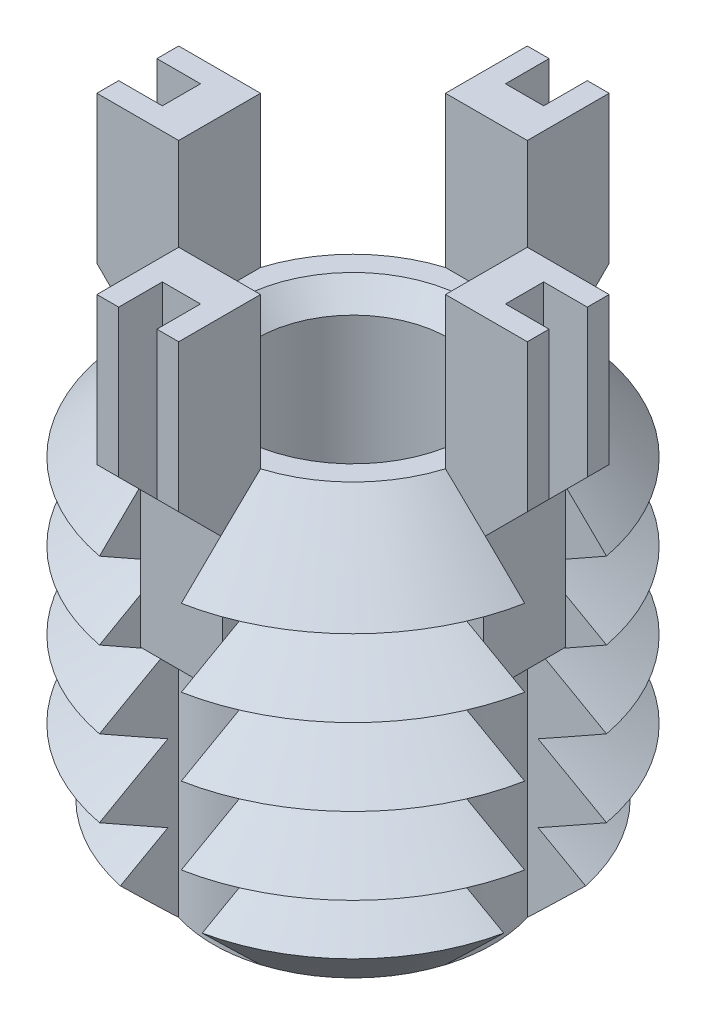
from build123d import *

# Parameters (mm, degrees)
SKETCH1_R               = 3.969
BOSS_EXTRUDE1_DEPTH     = 7.874
CHAMFER1_SIZE           = 1.411
LPATTERN1_COUNT         = 4
LPATTERN1_PITCH         = 1.411
CUT_EXTRUDE1_REACH      = 11.67
CIRPATTERN1_COUNT       = 4
BOSS_EXTRUDE3_DEPTH     = 0.75
CIRPATTERN2_COUNT       = 4
CUT_EXTRUDE3_DEPTH      = 13.015244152
CUT_EXTRUDE3_DEPTH_BACK = 13.015244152
SKETCH6_W               = 0.8
SKETCH6_H               = 0.7
SKETCH6_W_2             = 0.7
SKETCH6_H_2             = 0.8
SKETCH7_R               = 1.7525
CUT_EXTRUDE4_DEPTH      = 7.874
CHAMFER2_SIZE           = 0.397


with BuildPart() as part:
    # Sketch1 → Boss-Extrude1 (new body)
    with BuildSketch(Plane(origin=(0, 0, 0), x_dir=(1, 0, 0), z_dir=(0, 1, 0))):
        with Locations(Location((0, 0, 0), (0, 0, 270))):
            Circle(SKETCH1_R)
    extrude(amount=-BOSS_EXTRUDE1_DEPTH)

    # Chamfer1
    chamfer1_edges = [part.edges().sort_by_distance(p)[0] for p in [
        (0, 0, -3.969),
        (0, -7.874, -3.969),
    ]]
    chamfer(chamfer1_edges, length=CHAMFER1_SIZE)

    # Sketch3 → Cut-Revolve1 (revolve, cut)
    with BuildSketch(Plane(origin=(0, 0, 0), x_dir=(0, 0, -1), z_dir=(1, 0, 0))):
        Polygon((-3.969, -1.411), (-2.747038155, -2.1165), (-3.969, -2.822), align=None)
    cut_revolve1 = revolve(axis=Axis((0, 0.885892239, 0), (0, -1, 0)), mode=Mode.SUBTRACT)

    # LPattern1: Cut-Revolve1 ×4
    with Locations(*[(0, -i * LPATTERN1_PITCH, 0) for i in range(1, LPATTERN1_COUNT)]):
        add(cut_revolve1, mode=Mode.SUBTRACT)

    # Cut-Extrude1: up to this cone (the profile starts inside it)
    cut_extrude1_end = Plane(origin=(0, 0, 0), z_dir=(0, 1, 0)).offset(-10.431999) * Cone(1e-06, 33.034, 33.033999, align=(Align.CENTER, Align.CENTER, Align.MIN), mode=Mode.PRIVATE)
    # Sketch4 → Cut-Extrude1 (cut, up to the surface)
    with BuildSketch(Plane(origin=(0, 0, 0), x_dir=(1, 0, 0), z_dir=(0, 1, 0)), mode=Mode.PRIVATE) as cut_extrude1_sk1:
        with BuildLine():
            Line((-2.445580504, 0.75), (-3.897494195, 0.75))
            ThreePointArc((-3.897494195, 0.75), (-3.969, 0), (-3.897494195, -0.75))
            Line((-3.897494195, -0.75), (-2.445580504, -0.75))
            ThreePointArc((-2.445580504, -0.75), (-2.558, 0), (-2.445580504, 0.75))
        make_face()
    cut_extrude1_tool1 = extrude(cut_extrude1_sk1.sketch, amount=-CUT_EXTRUDE1_REACH, mode=Mode.PRIVATE) & cut_extrude1_end
    cut_extrude1 = cut_extrude1_tool1.solids().sort_by_distance((-3.232824, 0, 0))[0]
    add(cut_extrude1, mode=Mode.SUBTRACT)

    # CirPattern1: Cut-Extrude1 ×4 about axis
    cirpattern1_axis = Axis((0, 0, 0), (0, 1, 0))
    for i in range(1, CIRPATTERN1_COUNT):
        add(cut_extrude1.rotate(cirpattern1_axis, i * 360 / CIRPATTERN1_COUNT), mode=Mode.SUBTRACT)

    # Sketch5 → Boss-Extrude3 (add, symmetric)
    with BuildSketch(Plane(origin=(0, 0, 0), x_dir=(0, 0, -1), z_dir=(1, 0, 0))):
        Polygon((-2.445580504, 2.767), (-2.445580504, -3.233), (-3.145580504, -3.233), (-3.145580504, -0.733), (-3.945580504, 0.067), (-3.945580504, 2.767), align=None)
    boss_extrude3 = extrude(amount=BOSS_EXTRUDE3_DEPTH, both=True)

    # CirPattern2: Boss-Extrude3 ×4 about axis
    cirpattern2_axis = Axis((0, 0, 0), (0, 1, 0))
    for i in range(1, CIRPATTERN2_COUNT):
        add(boss_extrude3.rotate(cirpattern2_axis, i * 360 / CIRPATTERN2_COUNT))

    # Sketch6 → Cut-Extrude3 (cut, two sides: drawn at the far end of the back side and taken through both)
    with BuildSketch(Plane(origin=(0, 2.767, 0), x_dir=(1, 0, 0), z_dir=(0, 1, 0)).offset(-CUT_EXTRUDE3_DEPTH_BACK)):
        with Locations((-3.545580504, 0)):
            Rectangle(SKETCH6_W, SKETCH6_H)
        with Locations((0, 3.545580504)):
            Rectangle(SKETCH6_W_2, SKETCH6_H_2)
        with Locations((3.545580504, 0)):
            Rectangle(SKETCH6_W, SKETCH6_H)
        with Locations((0, -3.545580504)):
            Rectangle(SKETCH6_W_2, SKETCH6_H_2)
    extrude(amount=CUT_EXTRUDE3_DEPTH + CUT_EXTRUDE3_DEPTH_BACK, mode=Mode.SUBTRACT)

    # Sketch7 → Cut-Extrude4 (cut)
    with BuildSketch(Plane(origin=(0, 0, 0), x_dir=(1, 0, 0), z_dir=(0, 1, 0))):
        with Locations(Location((0, 0, 0), (0, 0, 270))):
            Circle(SKETCH7_R)
    extrude(amount=-CUT_EXTRUDE4_DEPTH, mode=Mode.SUBTRACT)

    # Chamfer2
    chamfer2_edges = [part.edges().sort_by_distance(p)[0] for p in [
        (0, 0, -1.7525),
        (0, -7.874, -1.7525),
    ]]
    chamfer(chamfer2_edges, length=CHAMFER2_SIZE)


solid = part.part
